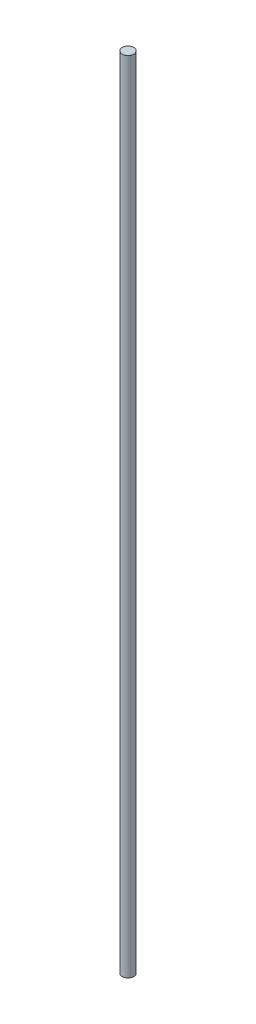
ISO-10303-21;
HEADER;
FILE_DESCRIPTION(('STEP AP214'),'2;1');
FILE_NAME('part.step','',(''),(''),'','','');
FILE_SCHEMA(('AUTOMOTIVE_DESIGN { 1 0 10303 214 1 1 1 1 }'));
ENDSEC;
DATA;
#1=APPLICATION_CONTEXT('core data for automotive mechanical design processes');
#2=APPLICATION_PROTOCOL_DEFINITION('international standard','automotive_design',2000,#1);
#3=PRODUCT_CONTEXT('',#1,'mechanical');
#4=PRODUCT('Part','Part','',(#3));
#5=PRODUCT_RELATED_PRODUCT_CATEGORY('part','',(#4));
#6=PRODUCT_DEFINITION_FORMATION('','',#4);
#7=PRODUCT_DEFINITION_CONTEXT('part definition',#1,'design');
#8=PRODUCT_DEFINITION('design','',#6,#7);
#9=PRODUCT_DEFINITION_SHAPE('','',#8);
#10=(LENGTH_UNIT() NAMED_UNIT(*) SI_UNIT(.MILLI.,.METRE.));
#11=(NAMED_UNIT(*) PLANE_ANGLE_UNIT() SI_UNIT($,.RADIAN.));
#12=(NAMED_UNIT(*) SI_UNIT($,.STERADIAN.) SOLID_ANGLE_UNIT());
#13=UNCERTAINTY_MEASURE_WITH_UNIT(LENGTH_MEASURE(1.E-05),#10,'distance_accuracy_value','');
#14=(GEOMETRIC_REPRESENTATION_CONTEXT(3) GLOBAL_UNCERTAINTY_ASSIGNED_CONTEXT((#13)) GLOBAL_UNIT_ASSIGNED_CONTEXT((#10,
#11,#12)) REPRESENTATION_CONTEXT('',''));
#15=CARTESIAN_POINT('',(0.,0.,0.));
#16=DIRECTION('',(0.,0.,1.));
#17=DIRECTION('',(1.,0.,0.));
#18=AXIS2_PLACEMENT_3D('',#15,#16,#17);
#19=CARTESIAN_POINT('',(8.,275.99995,8.99999999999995));
#20=DIRECTION('',(0.,1.,0.));
#21=DIRECTION('',(0.,0.,1.));
#22=AXIS2_PLACEMENT_3D('',#19,#20,#21);
#23=PLANE('',#22);
#24=CARTESIAN_POINT('',(8.,275.99995,8.99999999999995));
#25=DIRECTION('',(0.,1.,0.));
#26=DIRECTION('',(0.,0.,1.));
#27=AXIS2_PLACEMENT_3D('',#24,#25,#26);
#28=CIRCLE('',#27,2.);
#29=CARTESIAN_POINT('',(8.,275.99995,10.9999999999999));
#30=VERTEX_POINT('',#29);
#31=EDGE_CURVE('E17',#30,#30,#28,.F.);
#32=ORIENTED_EDGE('',*,*,#31,.F.);
#33=EDGE_LOOP('',(#32));
#34=FACE_BOUND('',#33,.T.);
#35=ADVANCED_FACE('F14',(#34),#23,.T.);
#36=CARTESIAN_POINT('',(8.,5.E-05,9.));
#37=DIRECTION('',(0.,-1.,0.));
#38=DIRECTION('',(0.,0.,-1.));
#39=AXIS2_PLACEMENT_3D('',#36,#37,#38);
#40=PLANE('',#39);
#41=CARTESIAN_POINT('',(8.,4.99999999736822E-05,9.));
#42=DIRECTION('',(0.,1.,0.));
#43=DIRECTION('',(0.,0.,1.));
#44=AXIS2_PLACEMENT_3D('',#41,#42,#43);
#45=CIRCLE('',#44,2.);
#46=CARTESIAN_POINT('',(8.,4.99999999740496E-05,11.));
#47=VERTEX_POINT('',#46);
#48=EDGE_CURVE('E10',#47,#47,#45,.T.);
#49=ORIENTED_EDGE('',*,*,#48,.F.);
#50=EDGE_LOOP('',(#49));
#51=FACE_BOUND('',#50,.T.);
#52=ADVANCED_FACE('F29',(#51),#40,.T.);
#53=CARTESIAN_POINT('',(8.,138.,8.99999999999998));
#54=DIRECTION('',(0.,1.,0.));
#55=DIRECTION('',(0.,0.,1.));
#56=AXIS2_PLACEMENT_3D('',#53,#54,#55);
#57=CYLINDRICAL_SURFACE('',#56,2.);
#58=ORIENTED_EDGE('',*,*,#31,.T.);
#59=EDGE_LOOP('',(#58));
#60=FACE_BOUND('',#59,.T.);
#61=ORIENTED_EDGE('',*,*,#48,.T.);
#62=EDGE_LOOP('',(#61));
#63=FACE_BOUND('',#62,.T.);
#64=ADVANCED_FACE('F26',(#60,#63),#57,.T.);
#65=CLOSED_SHELL('',(#35,#52,#64));
#66=MANIFOLD_SOLID_BREP('B1',#65);
#67=ADVANCED_BREP_SHAPE_REPRESENTATION('',(#18,#66),#14);
#68=SHAPE_DEFINITION_REPRESENTATION(#9,#67);
ENDSEC;
END-ISO-10303-21;
